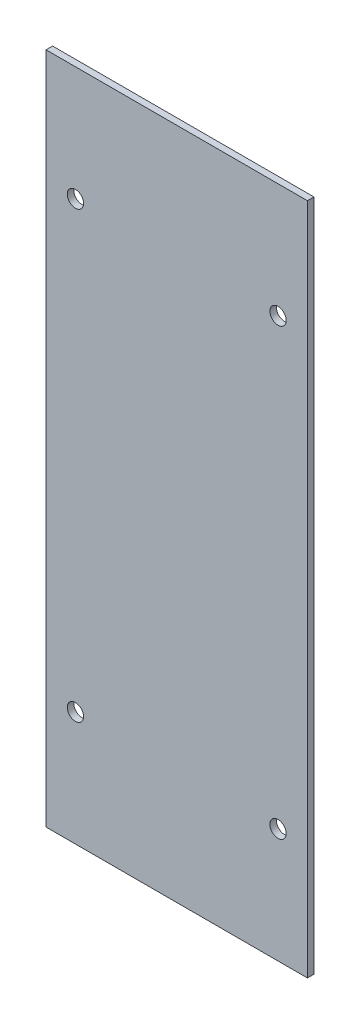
from build123d import *

# Parameters (mm, degrees)
SKETCH_1_W      = 80
SKETCH_1_H      = 206
SKETCH_1_R      = 2.5
EXTRUDE_1_DEPTH = 2


with BuildPart() as part:
    # Sketch 1 → Extrude 1 (new body)
    with BuildSketch(Plane.XY):
        Rectangle(SKETCH_1_W, SKETCH_1_H)
        with Locations((-31, 68)):
            Circle(SKETCH_1_R, mode=Mode.SUBTRACT)
        with Locations((31, 68)):
            Circle(SKETCH_1_R, mode=Mode.SUBTRACT)
        with Locations((-31, -68)):
            Circle(SKETCH_1_R, mode=Mode.SUBTRACT)
        with Locations((31, -68)):
            Circle(SKETCH_1_R, mode=Mode.SUBTRACT)
    extrude(amount=EXTRUDE_1_DEPTH)


solid = part.part
